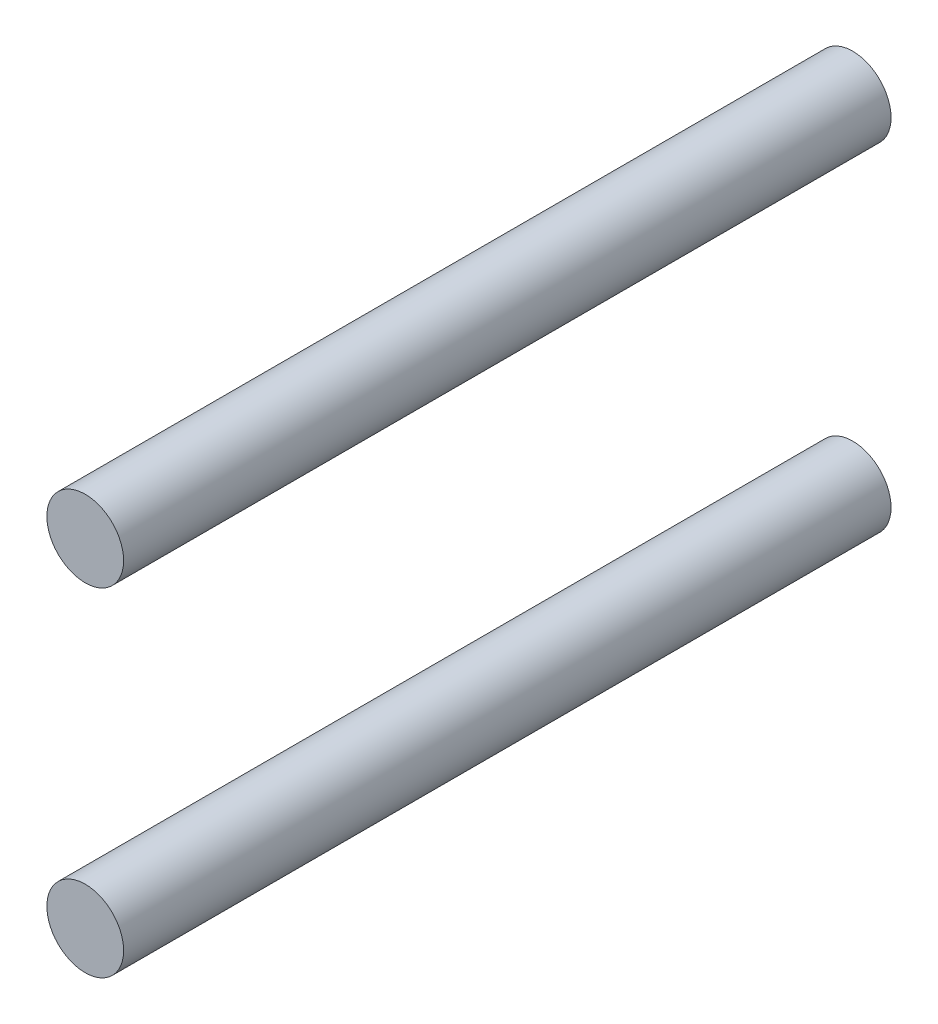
ISO-10303-21;
HEADER;
FILE_DESCRIPTION(('STEP AP214'),'2;1');
FILE_NAME('part.step','',(''),(''),'','','');
FILE_SCHEMA(('AUTOMOTIVE_DESIGN { 1 0 10303 214 1 1 1 1 }'));
ENDSEC;
DATA;
#1=APPLICATION_CONTEXT('core data for automotive mechanical design processes');
#2=APPLICATION_PROTOCOL_DEFINITION('international standard','automotive_design',2000,#1);
#3=PRODUCT_CONTEXT('',#1,'mechanical');
#4=PRODUCT('Part','Part','',(#3));
#5=PRODUCT_RELATED_PRODUCT_CATEGORY('part','',(#4));
#6=PRODUCT_DEFINITION_FORMATION('','',#4);
#7=PRODUCT_DEFINITION_CONTEXT('part definition',#1,'design');
#8=PRODUCT_DEFINITION('design','',#6,#7);
#9=PRODUCT_DEFINITION_SHAPE('','',#8);
#10=(LENGTH_UNIT() NAMED_UNIT(*) SI_UNIT(.MILLI.,.METRE.));
#11=(NAMED_UNIT(*) PLANE_ANGLE_UNIT() SI_UNIT($,.RADIAN.));
#12=(NAMED_UNIT(*) SI_UNIT($,.STERADIAN.) SOLID_ANGLE_UNIT());
#13=UNCERTAINTY_MEASURE_WITH_UNIT(LENGTH_MEASURE(1.E-05),#10,'distance_accuracy_value','');
#14=(GEOMETRIC_REPRESENTATION_CONTEXT(3) GLOBAL_UNCERTAINTY_ASSIGNED_CONTEXT((#13)) GLOBAL_UNIT_ASSIGNED_CONTEXT((#10,
#11,#12)) REPRESENTATION_CONTEXT('',''));
#15=CARTESIAN_POINT('',(0.,0.,0.));
#16=DIRECTION('',(0.,0.,1.));
#17=DIRECTION('',(1.,0.,0.));
#18=AXIS2_PLACEMENT_3D('',#15,#16,#17);
#19=CARTESIAN_POINT('',(0.,-10.,50.));
#20=DIRECTION('',(0.,0.,-1.));
#21=DIRECTION('',(-1.,0.,0.));
#22=AXIS2_PLACEMENT_3D('',#19,#20,#21);
#23=CYLINDRICAL_SURFACE('',#22,2.5);
#24=CARTESIAN_POINT('',(0.,-10.,50.));
#25=DIRECTION('',(0.,0.,1.));
#26=DIRECTION('',(1.,0.,0.));
#27=AXIS2_PLACEMENT_3D('',#24,#25,#26);
#28=CIRCLE('',#27,2.5);
#29=CARTESIAN_POINT('',(2.5,-10.,50.));
#30=VERTEX_POINT('',#29);
#31=EDGE_CURVE('E11',#30,#30,#28,.T.);
#32=ORIENTED_EDGE('',*,*,#31,.F.);
#33=EDGE_LOOP('',(#32));
#34=FACE_BOUND('',#33,.T.);
#35=CARTESIAN_POINT('',(0.,-10.,0.));
#36=DIRECTION('',(0.,0.,1.));
#37=DIRECTION('',(1.,0.,0.));
#38=AXIS2_PLACEMENT_3D('',#35,#36,#37);
#39=CIRCLE('',#38,2.5);
#40=CARTESIAN_POINT('',(2.5,-10.,0.));
#41=VERTEX_POINT('',#40);
#42=EDGE_CURVE('E43',#41,#41,#39,.T.);
#43=ORIENTED_EDGE('',*,*,#42,.T.);
#44=EDGE_LOOP('',(#43));
#45=FACE_BOUND('',#44,.T.);
#46=ADVANCED_FACE('F40',(#34,#45),#23,.T.);
#47=CARTESIAN_POINT('',(0.,-10.,50.));
#48=DIRECTION('',(0.,0.,1.));
#49=DIRECTION('',(1.,0.,0.));
#50=AXIS2_PLACEMENT_3D('',#47,#48,#49);
#51=PLANE('',#50);
#52=ORIENTED_EDGE('',*,*,#31,.T.);
#53=EDGE_LOOP('',(#52));
#54=FACE_BOUND('',#53,.T.);
#55=ADVANCED_FACE('F55',(#54),#51,.T.);
#56=CARTESIAN_POINT('',(0.,-10.,0.));
#57=DIRECTION('',(0.,0.,1.));
#58=DIRECTION('',(1.,0.,0.));
#59=AXIS2_PLACEMENT_3D('',#56,#57,#58);
#60=PLANE('',#59);
#61=ORIENTED_EDGE('',*,*,#42,.F.);
#62=EDGE_LOOP('',(#61));
#63=FACE_BOUND('',#62,.T.);
#64=ADVANCED_FACE('F53',(#63),#60,.F.);
#65=CLOSED_SHELL('',(#46,#55,#64));
#66=MANIFOLD_SOLID_BREP('B2',#65);
#67=CARTESIAN_POINT('',(0.,12.,50.));
#68=DIRECTION('',(0.,0.,-1.));
#69=DIRECTION('',(-1.,0.,0.));
#70=AXIS2_PLACEMENT_3D('',#67,#68,#69);
#71=CYLINDRICAL_SURFACE('',#70,2.5);
#72=CARTESIAN_POINT('',(0.,12.,50.));
#73=DIRECTION('',(0.,0.,1.));
#74=DIRECTION('',(1.,0.,0.));
#75=AXIS2_PLACEMENT_3D('',#72,#73,#74);
#76=CIRCLE('',#75,2.5);
#77=CARTESIAN_POINT('',(2.5,12.,50.));
#78=VERTEX_POINT('',#77);
#79=EDGE_CURVE('E39',#78,#78,#76,.T.);
#80=ORIENTED_EDGE('',*,*,#79,.F.);
#81=EDGE_LOOP('',(#80));
#82=FACE_BOUND('',#81,.T.);
#83=CARTESIAN_POINT('',(0.,12.,0.));
#84=DIRECTION('',(0.,0.,1.));
#85=DIRECTION('',(1.,0.,0.));
#86=AXIS2_PLACEMENT_3D('',#83,#84,#85);
#87=CIRCLE('',#86,2.5);
#88=CARTESIAN_POINT('',(2.5,12.,0.));
#89=VERTEX_POINT('',#88);
#90=EDGE_CURVE('E83',#89,#89,#87,.T.);
#91=ORIENTED_EDGE('',*,*,#90,.T.);
#92=EDGE_LOOP('',(#91));
#93=FACE_BOUND('',#92,.T.);
#94=ADVANCED_FACE('F80',(#82,#93),#71,.T.);
#95=CARTESIAN_POINT('',(0.,12.,50.));
#96=DIRECTION('',(0.,0.,1.));
#97=DIRECTION('',(1.,0.,0.));
#98=AXIS2_PLACEMENT_3D('',#95,#96,#97);
#99=PLANE('',#98);
#100=ORIENTED_EDGE('',*,*,#79,.T.);
#101=EDGE_LOOP('',(#100));
#102=FACE_BOUND('',#101,.T.);
#103=ADVANCED_FACE('F95',(#102),#99,.T.);
#104=CARTESIAN_POINT('',(0.,12.,0.));
#105=DIRECTION('',(0.,0.,1.));
#106=DIRECTION('',(1.,0.,0.));
#107=AXIS2_PLACEMENT_3D('',#104,#105,#106);
#108=PLANE('',#107);
#109=ORIENTED_EDGE('',*,*,#90,.F.);
#110=EDGE_LOOP('',(#109));
#111=FACE_BOUND('',#110,.T.);
#112=ADVANCED_FACE('F93',(#111),#108,.F.);
#113=CLOSED_SHELL('',(#94,#103,#112));
#114=MANIFOLD_SOLID_BREP('B6',#113);
#115=ADVANCED_BREP_SHAPE_REPRESENTATION('',(#18,#66,#114),#14);
#116=SHAPE_DEFINITION_REPRESENTATION(#9,#115);
ENDSEC;
END-ISO-10303-21;
